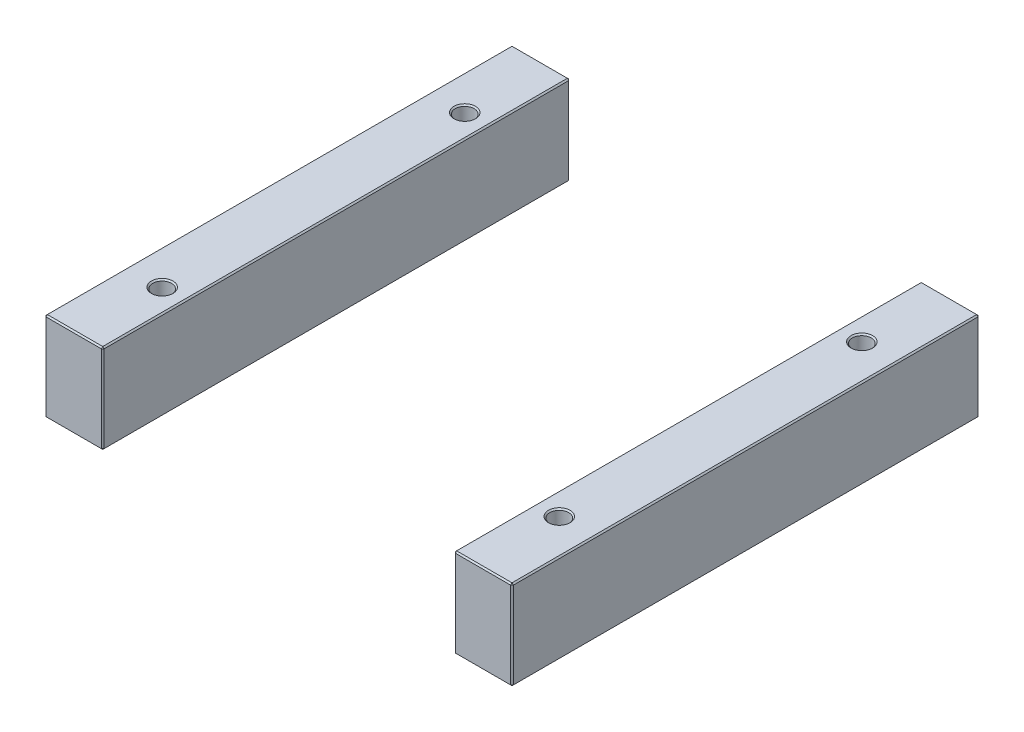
ISO-10303-21;
HEADER;
FILE_DESCRIPTION(('STEP AP214'),'2;1');
FILE_NAME('part.step','',(''),(''),'','','');
FILE_SCHEMA(('AUTOMOTIVE_DESIGN { 1 0 10303 214 1 1 1 1 }'));
ENDSEC;
DATA;
#1=APPLICATION_CONTEXT('core data for automotive mechanical design processes');
#2=APPLICATION_PROTOCOL_DEFINITION('international standard','automotive_design',2000,#1);
#3=PRODUCT_CONTEXT('',#1,'mechanical');
#4=PRODUCT('Part','Part','',(#3));
#5=PRODUCT_RELATED_PRODUCT_CATEGORY('part','',(#4));
#6=PRODUCT_DEFINITION_FORMATION('','',#4);
#7=PRODUCT_DEFINITION_CONTEXT('part definition',#1,'design');
#8=PRODUCT_DEFINITION('design','',#6,#7);
#9=PRODUCT_DEFINITION_SHAPE('','',#8);
#10=(LENGTH_UNIT() NAMED_UNIT(*) SI_UNIT(.MILLI.,.METRE.));
#11=(NAMED_UNIT(*) PLANE_ANGLE_UNIT() SI_UNIT($,.RADIAN.));
#12=(NAMED_UNIT(*) SI_UNIT($,.STERADIAN.) SOLID_ANGLE_UNIT());
#13=UNCERTAINTY_MEASURE_WITH_UNIT(LENGTH_MEASURE(1.E-05),#10,'distance_accuracy_value','');
#14=(GEOMETRIC_REPRESENTATION_CONTEXT(3) GLOBAL_UNCERTAINTY_ASSIGNED_CONTEXT((#13)) GLOBAL_UNIT_ASSIGNED_CONTEXT((#10,
#11,#12)) REPRESENTATION_CONTEXT('',''));
#15=CARTESIAN_POINT('',(0.,0.,0.));
#16=DIRECTION('',(0.,0.,1.));
#17=DIRECTION('',(1.,0.,0.));
#18=AXIS2_PLACEMENT_3D('',#15,#16,#17);
#19=CARTESIAN_POINT('',(-173.,66.,-173.));
#20=DIRECTION('',(0.,0.,1.));
#21=DIRECTION('',(1.,0.,0.));
#22=AXIS2_PLACEMENT_3D('',#19,#20,#21);
#23=PLANE('',#22);
#24=DIRECTION('',(-1.,0.,0.));
#25=VECTOR('',#24,1.);
#26=CARTESIAN_POINT('',(-173.,1.00000000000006,-173.));
#27=LINE('',#26,#25);
#28=CARTESIAN_POINT('',(-131.,1.00000000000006,-173.));
#29=VERTEX_POINT('',#28);
#30=CARTESIAN_POINT('',(-172.,1.00000000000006,-173.));
#31=VERTEX_POINT('',#30);
#32=EDGE_CURVE('P0_E137',#29,#31,#27,.T.);
#33=ORIENTED_EDGE('',*,*,#32,.T.);
#34=DIRECTION('',(0.,1.,0.));
#35=VECTOR('',#34,1.);
#36=CARTESIAN_POINT('',(-172.,66.,-173.));
#37=LINE('',#36,#35);
#38=CARTESIAN_POINT('',(-172.,65.,-173.));
#39=VERTEX_POINT('',#38);
#40=EDGE_CURVE('P0_E235',#31,#39,#37,.T.);
#41=ORIENTED_EDGE('',*,*,#40,.T.);
#42=DIRECTION('',(1.,0.,0.));
#43=VECTOR('',#42,1.);
#44=CARTESIAN_POINT('',(-173.,65.,-173.));
#45=LINE('',#44,#43);
#46=CARTESIAN_POINT('',(-131.,65.,-173.));
#47=VERTEX_POINT('',#46);
#48=EDGE_CURVE('P0_E233',#39,#47,#45,.T.);
#49=ORIENTED_EDGE('',*,*,#48,.T.);
#50=DIRECTION('',(0.,-1.,0.));
#51=VECTOR('',#50,1.);
#52=CARTESIAN_POINT('',(-131.,66.,-173.));
#53=LINE('',#52,#51);
#54=EDGE_CURVE('P0_E230',#47,#29,#53,.T.);
#55=ORIENTED_EDGE('',*,*,#54,.T.);
#56=EDGE_LOOP('',(#33,#41,#49,#55));
#57=FACE_BOUND('',#56,.T.);
#58=ADVANCED_FACE('P0_F16',(#57),#23,.F.);
#59=CARTESIAN_POINT('',(-173.,66.,173.));
#60=DIRECTION('',(1.,0.,0.));
#61=DIRECTION('',(0.,0.,-1.));
#62=AXIS2_PLACEMENT_3D('',#59,#60,#61);
#63=PLANE('',#62);
#64=DIRECTION('',(0.,1.,0.));
#65=VECTOR('',#64,1.);
#66=CARTESIAN_POINT('',(-173.,66.,172.));
#67=LINE('',#66,#65);
#68=CARTESIAN_POINT('',(-173.,1.00000000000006,172.));
#69=VERTEX_POINT('',#68);
#70=CARTESIAN_POINT('',(-173.,65.,172.));
#71=VERTEX_POINT('',#70);
#72=EDGE_CURVE('P0_E217',#69,#71,#67,.T.);
#73=ORIENTED_EDGE('',*,*,#72,.T.);
#74=DIRECTION('',(0.,0.,-1.));
#75=VECTOR('',#74,1.);
#76=CARTESIAN_POINT('',(-173.,65.,173.));
#77=LINE('',#76,#75);
#78=CARTESIAN_POINT('',(-173.,65.,-172.));
#79=VERTEX_POINT('',#78);
#80=EDGE_CURVE('P0_E228',#71,#79,#77,.T.);
#81=ORIENTED_EDGE('',*,*,#80,.T.);
#82=DIRECTION('',(0.,-1.,0.));
#83=VECTOR('',#82,1.);
#84=CARTESIAN_POINT('',(-173.,66.,-172.));
#85=LINE('',#84,#83);
#86=CARTESIAN_POINT('',(-173.,1.00000000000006,-172.));
#87=VERTEX_POINT('',#86);
#88=EDGE_CURVE('P0_E225',#79,#87,#85,.T.);
#89=ORIENTED_EDGE('',*,*,#88,.T.);
#90=DIRECTION('',(0.,0.,1.));
#91=VECTOR('',#90,1.);
#92=CARTESIAN_POINT('',(-173.,1.00000000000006,173.));
#93=LINE('',#92,#91);
#94=EDGE_CURVE('P0_E214',#87,#69,#93,.T.);
#95=ORIENTED_EDGE('',*,*,#94,.T.);
#96=EDGE_LOOP('',(#73,#81,#89,#95));
#97=FACE_BOUND('',#96,.T.);
#98=ADVANCED_FACE('P0_F302',(#97),#63,.F.);
#99=CARTESIAN_POINT('',(-173.,66.,173.));
#100=DIRECTION('',(0.,0.,-1.));
#101=DIRECTION('',(-1.,0.,0.));
#102=AXIS2_PLACEMENT_3D('',#99,#100,#101);
#103=PLANE('',#102);
#104=DIRECTION('',(-1.,0.,0.));
#105=VECTOR('',#104,1.);
#106=CARTESIAN_POINT('',(-173.,65.,173.));
#107=LINE('',#106,#105);
#108=CARTESIAN_POINT('',(-131.,65.,173.));
#109=VERTEX_POINT('',#108);
#110=CARTESIAN_POINT('',(-172.,65.,173.));
#111=VERTEX_POINT('',#110);
#112=EDGE_CURVE('P0_E242',#109,#111,#107,.T.);
#113=ORIENTED_EDGE('',*,*,#112,.T.);
#114=DIRECTION('',(0.,-1.,0.));
#115=VECTOR('',#114,1.);
#116=CARTESIAN_POINT('',(-172.,66.,173.));
#117=LINE('',#116,#115);
#118=CARTESIAN_POINT('',(-172.,1.00000000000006,173.));
#119=VERTEX_POINT('',#118);
#120=EDGE_CURVE('P0_E244',#111,#119,#117,.T.);
#121=ORIENTED_EDGE('',*,*,#120,.T.);
#122=DIRECTION('',(1.,0.,0.));
#123=VECTOR('',#122,1.);
#124=CARTESIAN_POINT('',(-130.,1.00000000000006,173.));
#125=LINE('',#124,#123);
#126=CARTESIAN_POINT('',(-131.,1.00000000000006,173.));
#127=VERTEX_POINT('',#126);
#128=EDGE_CURVE('P0_E240',#119,#127,#125,.T.);
#129=ORIENTED_EDGE('',*,*,#128,.T.);
#130=DIRECTION('',(0.,1.,0.));
#131=VECTOR('',#130,1.);
#132=CARTESIAN_POINT('',(-131.,66.,173.));
#133=LINE('',#132,#131);
#134=EDGE_CURVE('P0_E238',#127,#109,#133,.T.);
#135=ORIENTED_EDGE('',*,*,#134,.T.);
#136=EDGE_LOOP('',(#113,#121,#129,#135));
#137=FACE_BOUND('',#136,.T.);
#138=ADVANCED_FACE('P0_F341',(#137),#103,.F.);
#139=CARTESIAN_POINT('',(-130.,66.,-173.));
#140=DIRECTION('',(-1.,0.,0.));
#141=DIRECTION('',(0.,0.,1.));
#142=AXIS2_PLACEMENT_3D('',#139,#140,#141);
#143=PLANE('',#142);
#144=DIRECTION('',(0.,0.,1.));
#145=VECTOR('',#144,1.);
#146=CARTESIAN_POINT('',(-130.,65.,-173.));
#147=LINE('',#146,#145);
#148=CARTESIAN_POINT('',(-130.,65.,-172.));
#149=VERTEX_POINT('',#148);
#150=CARTESIAN_POINT('',(-130.,65.,172.));
#151=VERTEX_POINT('',#150);
#152=EDGE_CURVE('P0_E31',#149,#151,#147,.T.);
#153=ORIENTED_EDGE('',*,*,#152,.T.);
#154=DIRECTION('',(0.,-1.,0.));
#155=VECTOR('',#154,1.);
#156=CARTESIAN_POINT('',(-130.,66.,172.));
#157=LINE('',#156,#155);
#158=CARTESIAN_POINT('',(-130.,1.00000000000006,172.));
#159=VERTEX_POINT('',#158);
#160=EDGE_CURVE('P0_E190',#151,#159,#157,.T.);
#161=ORIENTED_EDGE('',*,*,#160,.T.);
#162=DIRECTION('',(0.,0.,-1.));
#163=VECTOR('',#162,1.);
#164=CARTESIAN_POINT('',(-130.,1.00000000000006,-173.));
#165=LINE('',#164,#163);
#166=CARTESIAN_POINT('',(-130.,1.00000000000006,-172.));
#167=VERTEX_POINT('',#166);
#168=EDGE_CURVE('P0_E256',#159,#167,#165,.T.);
#169=ORIENTED_EDGE('',*,*,#168,.T.);
#170=DIRECTION('',(0.,1.,0.));
#171=VECTOR('',#170,1.);
#172=CARTESIAN_POINT('',(-130.,66.,-172.));
#173=LINE('',#172,#171);
#174=EDGE_CURVE('P0_E36',#167,#149,#173,.T.);
#175=ORIENTED_EDGE('',*,*,#174,.T.);
#176=EDGE_LOOP('',(#153,#161,#169,#175));
#177=FACE_BOUND('',#176,.T.);
#178=ADVANCED_FACE('P0_F535',(#177),#143,.F.);
#179=CARTESIAN_POINT('',(0.,66.,0.));
#180=DIRECTION('',(0.,-1.,0.));
#181=DIRECTION('',(0.,0.,-1.));
#182=AXIS2_PLACEMENT_3D('',#179,#180,#181);
#183=PLANE('',#182);
#184=CARTESIAN_POINT('',(-147.,66.,112.));
#185=DIRECTION('',(0.,-1.,0.));
#186=DIRECTION('',(0.,0.,-1.));
#187=AXIS2_PLACEMENT_3D('',#184,#185,#186);
#188=CIRCLE('',#187,8.);
#189=CARTESIAN_POINT('',(-147.,66.,104.));
#190=VERTEX_POINT('',#189);
#191=EDGE_CURVE('P0_E24',#190,#190,#188,.T.);
#192=ORIENTED_EDGE('',*,*,#191,.T.);
#193=EDGE_LOOP('',(#192));
#194=FACE_BOUND('',#193,.T.);
#195=CARTESIAN_POINT('',(-147.,66.,-112.));
#196=DIRECTION('',(0.,-1.,0.));
#197=DIRECTION('',(0.,0.,-1.));
#198=AXIS2_PLACEMENT_3D('',#195,#196,#197);
#199=CIRCLE('',#198,8.);
#200=CARTESIAN_POINT('',(-147.,66.,-120.));
#201=VERTEX_POINT('',#200);
#202=EDGE_CURVE('P0_E189',#201,#201,#199,.T.);
#203=ORIENTED_EDGE('',*,*,#202,.T.);
#204=EDGE_LOOP('',(#203));
#205=FACE_BOUND('',#204,.T.);
#206=DIRECTION('',(0.,0.,1.));
#207=VECTOR('',#206,1.);
#208=CARTESIAN_POINT('',(-172.,66.,0.));
#209=LINE('',#208,#207);
#210=CARTESIAN_POINT('',(-172.,66.,-172.));
#211=VERTEX_POINT('',#210);
#212=CARTESIAN_POINT('',(-172.,66.,172.));
#213=VERTEX_POINT('',#212);
#214=EDGE_CURVE('P0_E251',#211,#213,#209,.T.);
#215=ORIENTED_EDGE('',*,*,#214,.T.);
#216=DIRECTION('',(1.,0.,0.));
#217=VECTOR('',#216,1.);
#218=CARTESIAN_POINT('',(1.11022302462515E-13,66.,172.));
#219=LINE('',#218,#217);
#220=CARTESIAN_POINT('',(-131.,66.,172.));
#221=VERTEX_POINT('',#220);
#222=EDGE_CURVE('P0_E253',#213,#221,#219,.T.);
#223=ORIENTED_EDGE('',*,*,#222,.T.);
#224=DIRECTION('',(0.,0.,-1.));
#225=VECTOR('',#224,1.);
#226=CARTESIAN_POINT('',(-131.,66.,0.));
#227=LINE('',#226,#225);
#228=CARTESIAN_POINT('',(-131.,66.,-172.));
#229=VERTEX_POINT('',#228);
#230=EDGE_CURVE('P0_E247',#221,#229,#227,.T.);
#231=ORIENTED_EDGE('',*,*,#230,.T.);
#232=DIRECTION('',(-1.,0.,0.));
#233=VECTOR('',#232,1.);
#234=CARTESIAN_POINT('',(-1.11022302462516E-13,66.,-172.));
#235=LINE('',#234,#233);
#236=EDGE_CURVE('P0_E249',#229,#211,#235,.T.);
#237=ORIENTED_EDGE('',*,*,#236,.T.);
#238=EDGE_LOOP('',(#215,#223,#231,#237));
#239=FACE_BOUND('',#238,.T.);
#240=ADVANCED_FACE('P0_F195',(#194,#205,#239),#183,.F.);
#241=CARTESIAN_POINT('',(0.,0.,0.));
#242=DIRECTION('',(0.,-1.,0.));
#243=DIRECTION('',(0.,0.,-1.));
#244=AXIS2_PLACEMENT_3D('',#241,#242,#243);
#245=PLANE('',#244);
#246=CARTESIAN_POINT('',(-147.,0.,-112.));
#247=DIRECTION('',(0.,-1.,0.));
#248=DIRECTION('',(0.,0.,-1.));
#249=AXIS2_PLACEMENT_3D('',#246,#247,#248);
#250=CIRCLE('',#249,8.);
#251=CARTESIAN_POINT('',(-147.,0.,-120.));
#252=VERTEX_POINT('',#251);
#253=EDGE_CURVE('P0_E220',#252,#252,#250,.F.);
#254=ORIENTED_EDGE('',*,*,#253,.T.);
#255=EDGE_LOOP('',(#254));
#256=FACE_BOUND('',#255,.T.);
#257=CARTESIAN_POINT('',(-147.,0.,112.));
#258=DIRECTION('',(0.,-1.,0.));
#259=DIRECTION('',(0.,0.,-1.));
#260=AXIS2_PLACEMENT_3D('',#257,#258,#259);
#261=CIRCLE('',#260,8.);
#262=CARTESIAN_POINT('',(-147.,0.,104.));
#263=VERTEX_POINT('',#262);
#264=EDGE_CURVE('P0_E608',#263,#263,#261,.F.);
#265=ORIENTED_EDGE('',*,*,#264,.T.);
#266=EDGE_LOOP('',(#265));
#267=FACE_BOUND('',#266,.T.);
#268=DIRECTION('',(-1.,0.,0.));
#269=VECTOR('',#268,1.);
#270=CARTESIAN_POINT('',(-173.,0.,172.));
#271=LINE('',#270,#269);
#272=CARTESIAN_POINT('',(-131.,0.,172.));
#273=VERTEX_POINT('',#272);
#274=CARTESIAN_POINT('',(-172.,0.,172.));
#275=VERTEX_POINT('',#274);
#276=EDGE_CURVE('P0_E114',#273,#275,#271,.T.);
#277=ORIENTED_EDGE('',*,*,#276,.T.);
#278=DIRECTION('',(0.,0.,-1.));
#279=VECTOR('',#278,1.);
#280=CARTESIAN_POINT('',(-172.,0.,-173.));
#281=LINE('',#280,#279);
#282=CARTESIAN_POINT('',(-172.,0.,-172.));
#283=VERTEX_POINT('',#282);
#284=EDGE_CURVE('P0_E110',#275,#283,#281,.T.);
#285=ORIENTED_EDGE('',*,*,#284,.T.);
#286=DIRECTION('',(1.,0.,0.));
#287=VECTOR('',#286,1.);
#288=CARTESIAN_POINT('',(-130.,0.,-172.));
#289=LINE('',#288,#287);
#290=CARTESIAN_POINT('',(-131.,0.,-172.));
#291=VERTEX_POINT('',#290);
#292=EDGE_CURVE('P0_E104',#283,#291,#289,.T.);
#293=ORIENTED_EDGE('',*,*,#292,.T.);
#294=DIRECTION('',(0.,0.,1.));
#295=VECTOR('',#294,1.);
#296=CARTESIAN_POINT('',(-131.,0.,173.));
#297=LINE('',#296,#295);
#298=EDGE_CURVE('P0_E107',#291,#273,#297,.T.);
#299=ORIENTED_EDGE('',*,*,#298,.T.);
#300=EDGE_LOOP('',(#277,#285,#293,#299));
#301=FACE_BOUND('',#300,.T.);
#302=ADVANCED_FACE('P0_F106',(#256,#267,#301),#245,.T.);
#303=CARTESIAN_POINT('',(-147.,0.,-112.));
#304=DIRECTION('',(0.,1.,0.));
#305=DIRECTION('',(0.,0.,1.));
#306=AXIS2_PLACEMENT_3D('',#303,#304,#305);
#307=CYLINDRICAL_SURFACE('',#306,7.);
#308=CARTESIAN_POINT('',(-147.,65.,-112.));
#309=DIRECTION('',(0.,-1.,0.));
#310=DIRECTION('',(0.,0.,-1.));
#311=AXIS2_PLACEMENT_3D('',#308,#309,#310);
#312=CIRCLE('',#311,7.);
#313=CARTESIAN_POINT('',(-147.,65.,-119.));
#314=VERTEX_POINT('',#313);
#315=EDGE_CURVE('P0_E10',#314,#314,#312,.F.);
#316=ORIENTED_EDGE('',*,*,#315,.T.);
#317=EDGE_LOOP('',(#316));
#318=FACE_BOUND('',#317,.T.);
#319=CARTESIAN_POINT('',(-147.,0.999999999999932,-112.));
#320=DIRECTION('',(0.,-1.,0.));
#321=DIRECTION('',(0.,0.,-1.));
#322=AXIS2_PLACEMENT_3D('',#319,#320,#321);
#323=CIRCLE('',#322,7.);
#324=CARTESIAN_POINT('',(-147.,0.999999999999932,-119.));
#325=VERTEX_POINT('',#324);
#326=EDGE_CURVE('P0_E215',#325,#325,#323,.T.);
#327=ORIENTED_EDGE('',*,*,#326,.T.);
#328=EDGE_LOOP('',(#327));
#329=FACE_BOUND('',#328,.T.);
#330=ADVANCED_FACE('P0_F208',(#318,#329),#307,.F.);
#331=CARTESIAN_POINT('',(-147.,0.,112.));
#332=DIRECTION('',(0.,1.,0.));
#333=DIRECTION('',(0.,0.,1.));
#334=AXIS2_PLACEMENT_3D('',#331,#332,#333);
#335=CYLINDRICAL_SURFACE('',#334,7.);
#336=CARTESIAN_POINT('',(-147.,65.,112.));
#337=DIRECTION('',(0.,-1.,0.));
#338=DIRECTION('',(0.,0.,-1.));
#339=AXIS2_PLACEMENT_3D('',#336,#337,#338);
#340=CIRCLE('',#339,7.);
#341=CARTESIAN_POINT('',(-147.,65.,105.));
#342=VERTEX_POINT('',#341);
#343=EDGE_CURVE('P0_E186',#342,#342,#340,.F.);
#344=ORIENTED_EDGE('',*,*,#343,.T.);
#345=EDGE_LOOP('',(#344));
#346=FACE_BOUND('',#345,.T.);
#347=CARTESIAN_POINT('',(-147.,0.999999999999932,112.));
#348=DIRECTION('',(0.,-1.,0.));
#349=DIRECTION('',(0.,0.,-1.));
#350=AXIS2_PLACEMENT_3D('',#347,#348,#349);
#351=CIRCLE('',#350,7.);
#352=CARTESIAN_POINT('',(-147.,0.999999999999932,105.));
#353=VERTEX_POINT('',#352);
#354=EDGE_CURVE('P0_E212',#353,#353,#351,.T.);
#355=ORIENTED_EDGE('',*,*,#354,.T.);
#356=EDGE_LOOP('',(#355));
#357=FACE_BOUND('',#356,.T.);
#358=ADVANCED_FACE('P0_F204',(#346,#357),#335,.F.);
#359=CARTESIAN_POINT('',(-147.,0.,-112.));
#360=DIRECTION('',(0.,-1.,0.));
#361=DIRECTION('',(0.,0.,-1.));
#362=AXIS2_PLACEMENT_3D('',#359,#360,#361);
#363=CONICAL_SURFACE('',#362,8.,0.785398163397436);
#364=ORIENTED_EDGE('',*,*,#326,.F.);
#365=EDGE_LOOP('',(#364));
#366=FACE_BOUND('',#365,.T.);
#367=ORIENTED_EDGE('',*,*,#253,.F.);
#368=EDGE_LOOP('',(#367));
#369=FACE_BOUND('',#368,.T.);
#370=ADVANCED_FACE('P0_F207',(#366,#369),#363,.F.);
#371=CARTESIAN_POINT('',(-147.,0.,112.));
#372=DIRECTION('',(0.,-1.,0.));
#373=DIRECTION('',(0.,0.,-1.));
#374=AXIS2_PLACEMENT_3D('',#371,#372,#373);
#375=CONICAL_SURFACE('',#374,8.,0.785398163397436);
#376=ORIENTED_EDGE('',*,*,#354,.F.);
#377=EDGE_LOOP('',(#376));
#378=FACE_BOUND('',#377,.T.);
#379=ORIENTED_EDGE('',*,*,#264,.F.);
#380=EDGE_LOOP('',(#379));
#381=FACE_BOUND('',#380,.T.);
#382=ADVANCED_FACE('P0_F347',(#378,#381),#375,.F.);
#383=CARTESIAN_POINT('',(-130.,66.,172.));
#384=DIRECTION('',(-0.707106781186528,0.,-0.707106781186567));
#385=DIRECTION('',(0.,-1.,0.));
#386=AXIS2_PLACEMENT_3D('',#383,#384,#385);
#387=PLANE('',#386);
#388=DIRECTION('',(-0.707106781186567,0.,0.707106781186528));
#389=VECTOR('',#388,1.);
#390=CARTESIAN_POINT('',(-130.5,65.,172.5));
#391=LINE('',#390,#389);
#392=EDGE_CURVE('P0_E125',#109,#151,#391,.F.);
#393=ORIENTED_EDGE('',*,*,#392,.F.);
#394=ORIENTED_EDGE('',*,*,#134,.F.);
#395=DIRECTION('',(0.707106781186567,0.,-0.707106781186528));
#396=VECTOR('',#395,1.);
#397=CARTESIAN_POINT('',(-131.,1.00000000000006,173.));
#398=LINE('',#397,#396);
#399=EDGE_CURVE('P0_E181',#159,#127,#398,.F.);
#400=ORIENTED_EDGE('',*,*,#399,.F.);
#401=ORIENTED_EDGE('',*,*,#160,.F.);
#402=EDGE_LOOP('',(#393,#394,#400,#401));
#403=FACE_BOUND('',#402,.T.);
#404=ADVANCED_FACE('P0_F351',(#403),#387,.F.);
#405=CARTESIAN_POINT('',(-131.,66.,172.));
#406=DIRECTION('',(0.577350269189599,0.577350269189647,0.577350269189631));
#407=DIRECTION('',(0.,-0.707106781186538,0.707106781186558));
#408=AXIS2_PLACEMENT_3D('',#405,#406,#407);
#409=PLANE('',#408);
#410=DIRECTION('',(0.,0.707106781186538,-0.707106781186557));
#411=VECTOR('',#410,1.);
#412=CARTESIAN_POINT('',(-131.,66.,172.));
#413=LINE('',#412,#411);
#414=EDGE_CURVE('P0_E175',#109,#221,#413,.T.);
#415=ORIENTED_EDGE('',*,*,#414,.F.);
#416=ORIENTED_EDGE('',*,*,#392,.T.);
#417=DIRECTION('',(0.707106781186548,-0.707106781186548,0.));
#418=VECTOR('',#417,1.);
#419=CARTESIAN_POINT('',(-131.,66.,172.));
#420=LINE('',#419,#418);
#421=EDGE_CURVE('P0_E178',#221,#151,#420,.T.);
#422=ORIENTED_EDGE('',*,*,#421,.F.);
#423=EDGE_LOOP('',(#415,#416,#422));
#424=FACE_BOUND('',#423,.T.);
#425=ADVANCED_FACE('P0_F487',(#424),#409,.T.);
#426=CARTESIAN_POINT('',(-131.,1.00000000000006,173.));
#427=DIRECTION('',(0.577350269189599,-0.577350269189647,0.577350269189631));
#428=DIRECTION('',(0.,-0.707106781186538,-0.707106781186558));
#429=AXIS2_PLACEMENT_3D('',#426,#427,#428);
#430=PLANE('',#429);
#431=DIRECTION('',(0.707106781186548,0.707106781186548,0.));
#432=VECTOR('',#431,1.);
#433=CARTESIAN_POINT('',(-130.5,0.50000000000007,172.));
#434=LINE('',#433,#432);
#435=EDGE_CURVE('P0_E123',#159,#273,#434,.F.);
#436=ORIENTED_EDGE('',*,*,#435,.F.);
#437=ORIENTED_EDGE('',*,*,#399,.T.);
#438=DIRECTION('',(0.,-0.707106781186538,-0.707106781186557));
#439=VECTOR('',#438,1.);
#440=CARTESIAN_POINT('',(-131.,1.00000000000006,173.));
#441=LINE('',#440,#439);
#442=EDGE_CURVE('P0_E172',#273,#127,#441,.F.);
#443=ORIENTED_EDGE('',*,*,#442,.F.);
#444=EDGE_LOOP('',(#436,#437,#443));
#445=FACE_BOUND('',#444,.T.);
#446=ADVANCED_FACE('P0_F478',(#445),#430,.T.);
#447=CARTESIAN_POINT('',(-131.,66.,0.));
#448=DIRECTION('',(-0.707106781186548,-0.707106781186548,0.));
#449=DIRECTION('',(0.,0.,-1.));
#450=AXIS2_PLACEMENT_3D('',#447,#448,#449);
#451=PLANE('',#450);
#452=ORIENTED_EDGE('',*,*,#421,.T.);
#453=ORIENTED_EDGE('',*,*,#152,.F.);
#454=DIRECTION('',(-0.707106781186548,0.707106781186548,0.));
#455=VECTOR('',#454,1.);
#456=CARTESIAN_POINT('',(-130.5,65.5,-172.));
#457=LINE('',#456,#455);
#458=EDGE_CURVE('P0_E165',#229,#149,#457,.F.);
#459=ORIENTED_EDGE('',*,*,#458,.F.);
#460=ORIENTED_EDGE('',*,*,#230,.F.);
#461=EDGE_LOOP('',(#452,#453,#459,#460));
#462=FACE_BOUND('',#461,.T.);
#463=ADVANCED_FACE('P0_F318',(#462),#451,.F.);
#464=CARTESIAN_POINT('',(1.11022302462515E-13,66.,172.));
#465=DIRECTION('',(0.,-0.707106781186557,-0.707106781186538));
#466=DIRECTION('',(1.,0.,0.));
#467=AXIS2_PLACEMENT_3D('',#464,#465,#466);
#468=PLANE('',#467);
#469=ORIENTED_EDGE('',*,*,#414,.T.);
#470=ORIENTED_EDGE('',*,*,#222,.F.);
#471=DIRECTION('',(0.,-0.707106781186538,0.707106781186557));
#472=VECTOR('',#471,1.);
#473=CARTESIAN_POINT('',(-172.,65.5,172.5));
#474=LINE('',#473,#472);
#475=EDGE_CURVE('P0_E162',#111,#213,#474,.F.);
#476=ORIENTED_EDGE('',*,*,#475,.F.);
#477=ORIENTED_EDGE('',*,*,#112,.F.);
#478=EDGE_LOOP('',(#469,#470,#476,#477));
#479=FACE_BOUND('',#478,.T.);
#480=ADVANCED_FACE('P0_F313',(#479),#468,.F.);
#481=CARTESIAN_POINT('',(-172.,66.,173.));
#482=DIRECTION('',(0.707106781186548,0.,-0.707106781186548));
#483=DIRECTION('',(0.,-1.,0.));
#484=AXIS2_PLACEMENT_3D('',#481,#482,#483);
#485=PLANE('',#484);
#486=DIRECTION('',(0.707106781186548,0.,0.707106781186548));
#487=VECTOR('',#486,1.);
#488=CARTESIAN_POINT('',(-172.,1.00000000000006,173.));
#489=LINE('',#488,#487);
#490=EDGE_CURVE('P0_E156',#119,#69,#489,.F.);
#491=ORIENTED_EDGE('',*,*,#490,.F.);
#492=ORIENTED_EDGE('',*,*,#120,.F.);
#493=DIRECTION('',(-0.707106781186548,0.,-0.707106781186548));
#494=VECTOR('',#493,1.);
#495=CARTESIAN_POINT('',(-173.,65.,172.));
#496=LINE('',#495,#494);
#497=EDGE_CURVE('P0_E159',#71,#111,#496,.F.);
#498=ORIENTED_EDGE('',*,*,#497,.F.);
#499=ORIENTED_EDGE('',*,*,#72,.F.);
#500=EDGE_LOOP('',(#491,#492,#498,#499));
#501=FACE_BOUND('',#500,.T.);
#502=ADVANCED_FACE('P0_F307',(#501),#485,.F.);
#503=CARTESIAN_POINT('',(-173.,1.00000000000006,173.));
#504=DIRECTION('',(0.,-0.707106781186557,0.707106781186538));
#505=DIRECTION('',(-1.,0.,0.));
#506=AXIS2_PLACEMENT_3D('',#503,#504,#505);
#507=PLANE('',#506);
#508=ORIENTED_EDGE('',*,*,#442,.T.);
#509=ORIENTED_EDGE('',*,*,#128,.F.);
#510=DIRECTION('',(0.,0.707106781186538,0.707106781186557));
#511=VECTOR('',#510,1.);
#512=CARTESIAN_POINT('',(-172.,1.00000000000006,173.));
#513=LINE('',#512,#511);
#514=EDGE_CURVE('P0_E134',#275,#119,#513,.T.);
#515=ORIENTED_EDGE('',*,*,#514,.F.);
#516=ORIENTED_EDGE('',*,*,#276,.F.);
#517=EDGE_LOOP('',(#508,#509,#515,#516));
#518=FACE_BOUND('',#517,.T.);
#519=ADVANCED_FACE('P0_F333',(#518),#507,.T.);
#520=CARTESIAN_POINT('',(-130.,1.00000000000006,-173.));
#521=DIRECTION('',(0.707106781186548,-0.707106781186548,0.));
#522=DIRECTION('',(0.,0.,1.));
#523=AXIS2_PLACEMENT_3D('',#520,#521,#522);
#524=PLANE('',#523);
#525=ORIENTED_EDGE('',*,*,#435,.T.);
#526=ORIENTED_EDGE('',*,*,#298,.F.);
#527=DIRECTION('',(-0.707106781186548,-0.707106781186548,0.));
#528=VECTOR('',#527,1.);
#529=CARTESIAN_POINT('',(-131.,0.,-172.));
#530=LINE('',#529,#528);
#531=EDGE_CURVE('P0_E120',#167,#291,#530,.T.);
#532=ORIENTED_EDGE('',*,*,#531,.F.);
#533=ORIENTED_EDGE('',*,*,#168,.F.);
#534=EDGE_LOOP('',(#525,#526,#532,#533));
#535=FACE_BOUND('',#534,.T.);
#536=ADVANCED_FACE('P0_F119',(#535),#524,.T.);
#537=CARTESIAN_POINT('',(-131.,66.,-173.));
#538=DIRECTION('',(-0.707106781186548,0.,0.707106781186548));
#539=DIRECTION('',(0.,-1.,0.));
#540=AXIS2_PLACEMENT_3D('',#537,#538,#539);
#541=PLANE('',#540);
#542=DIRECTION('',(0.707106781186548,0.,0.707106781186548));
#543=VECTOR('',#542,1.);
#544=CARTESIAN_POINT('',(-131.,65.,-173.));
#545=LINE('',#544,#543);
#546=EDGE_CURVE('P0_E168',#149,#47,#545,.F.);
#547=ORIENTED_EDGE('',*,*,#546,.F.);
#548=ORIENTED_EDGE('',*,*,#174,.F.);
#549=DIRECTION('',(-0.707106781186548,0.,-0.707106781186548));
#550=VECTOR('',#549,1.);
#551=CARTESIAN_POINT('',(-130.5,1.00000000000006,-172.5));
#552=LINE('',#551,#550);
#553=EDGE_CURVE('P0_E133',#29,#167,#552,.F.);
#554=ORIENTED_EDGE('',*,*,#553,.F.);
#555=ORIENTED_EDGE('',*,*,#54,.F.);
#556=EDGE_LOOP('',(#547,#548,#554,#555));
#557=FACE_BOUND('',#556,.T.);
#558=ADVANCED_FACE('P0_F323',(#557),#541,.F.);
#559=CARTESIAN_POINT('',(-131.,65.,-173.));
#560=DIRECTION('',(0.57735026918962,0.577350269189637,-0.57735026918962));
#561=DIRECTION('',(0.,0.707106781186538,0.707106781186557));
#562=AXIS2_PLACEMENT_3D('',#559,#560,#561);
#563=PLANE('',#562);
#564=ORIENTED_EDGE('',*,*,#458,.T.);
#565=ORIENTED_EDGE('',*,*,#546,.T.);
#566=DIRECTION('',(0.,-0.707106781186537,-0.707106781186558));
#567=VECTOR('',#566,1.);
#568=CARTESIAN_POINT('',(-131.,65.,-173.));
#569=LINE('',#568,#567);
#570=EDGE_CURVE('P0_E151',#229,#47,#569,.T.);
#571=ORIENTED_EDGE('',*,*,#570,.F.);
#572=EDGE_LOOP('',(#564,#565,#571));
#573=FACE_BOUND('',#572,.T.);
#574=ADVANCED_FACE('P0_F321',(#573),#563,.T.);
#575=CARTESIAN_POINT('',(-173.,65.,172.));
#576=DIRECTION('',(-0.57735026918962,0.577350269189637,0.57735026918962));
#577=DIRECTION('',(0.,-0.707106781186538,0.707106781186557));
#578=AXIS2_PLACEMENT_3D('',#575,#576,#577);
#579=PLANE('',#578);
#580=ORIENTED_EDGE('',*,*,#497,.T.);
#581=ORIENTED_EDGE('',*,*,#475,.T.);
#582=DIRECTION('',(0.707106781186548,0.707106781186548,0.));
#583=VECTOR('',#582,1.);
#584=CARTESIAN_POINT('',(-173.,65.,172.));
#585=LINE('',#584,#583);
#586=EDGE_CURVE('P0_E142',#71,#213,#585,.T.);
#587=ORIENTED_EDGE('',*,*,#586,.F.);
#588=EDGE_LOOP('',(#580,#581,#587));
#589=FACE_BOUND('',#588,.T.);
#590=ADVANCED_FACE('P0_F310',(#589),#579,.T.);
#591=CARTESIAN_POINT('',(-172.,1.00000000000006,173.));
#592=DIRECTION('',(-0.57735026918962,-0.577350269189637,0.57735026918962));
#593=DIRECTION('',(0.,-0.707106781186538,-0.707106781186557));
#594=AXIS2_PLACEMENT_3D('',#591,#592,#593);
#595=PLANE('',#594);
#596=ORIENTED_EDGE('',*,*,#514,.T.);
#597=ORIENTED_EDGE('',*,*,#490,.T.);
#598=DIRECTION('',(0.707106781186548,-0.707106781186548,0.));
#599=VECTOR('',#598,1.);
#600=CARTESIAN_POINT('',(-172.5,0.500000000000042,172.));
#601=LINE('',#600,#599);
#602=EDGE_CURVE('P0_E138',#275,#69,#601,.F.);
#603=ORIENTED_EDGE('',*,*,#602,.F.);
#604=EDGE_LOOP('',(#596,#597,#603));
#605=FACE_BOUND('',#604,.T.);
#606=ADVANCED_FACE('P0_F368',(#605),#595,.T.);
#607=CARTESIAN_POINT('',(-131.,0.,-172.));
#608=DIRECTION('',(0.57735026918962,-0.577350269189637,-0.57735026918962));
#609=DIRECTION('',(0.,0.707106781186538,-0.707106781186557));
#610=AXIS2_PLACEMENT_3D('',#607,#608,#609);
#611=PLANE('',#610);
#612=ORIENTED_EDGE('',*,*,#553,.T.);
#613=ORIENTED_EDGE('',*,*,#531,.T.);
#614=DIRECTION('',(0.,0.707106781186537,-0.707106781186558));
#615=VECTOR('',#614,1.);
#616=CARTESIAN_POINT('',(-131.,0.,-172.));
#617=LINE('',#616,#615);
#618=EDGE_CURVE('P0_E130',#29,#291,#617,.F.);
#619=ORIENTED_EDGE('',*,*,#618,.F.);
#620=EDGE_LOOP('',(#612,#613,#619));
#621=FACE_BOUND('',#620,.T.);
#622=ADVANCED_FACE('P0_F129',(#621),#611,.T.);
#623=CARTESIAN_POINT('',(-1.11022302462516E-13,66.,-172.));
#624=DIRECTION('',(0.,-0.707106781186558,0.707106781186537));
#625=DIRECTION('',(-1.,0.,0.));
#626=AXIS2_PLACEMENT_3D('',#623,#624,#625);
#627=PLANE('',#626);
#628=ORIENTED_EDGE('',*,*,#570,.T.);
#629=ORIENTED_EDGE('',*,*,#48,.F.);
#630=DIRECTION('',(0.,0.707106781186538,0.707106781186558));
#631=VECTOR('',#630,1.);
#632=CARTESIAN_POINT('',(-172.,65.,-173.));
#633=LINE('',#632,#631);
#634=EDGE_CURVE('P0_E139',#211,#39,#633,.F.);
#635=ORIENTED_EDGE('',*,*,#634,.F.);
#636=ORIENTED_EDGE('',*,*,#236,.F.);
#637=EDGE_LOOP('',(#628,#629,#635,#636));
#638=FACE_BOUND('',#637,.T.);
#639=ADVANCED_FACE('P0_F286',(#638),#627,.F.);
#640=CARTESIAN_POINT('',(-172.,66.,0.));
#641=DIRECTION('',(0.707106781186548,-0.707106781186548,0.));
#642=DIRECTION('',(0.,0.,1.));
#643=AXIS2_PLACEMENT_3D('',#640,#641,#642);
#644=PLANE('',#643);
#645=ORIENTED_EDGE('',*,*,#586,.T.);
#646=ORIENTED_EDGE('',*,*,#214,.F.);
#647=DIRECTION('',(-0.707106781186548,-0.707106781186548,0.));
#648=VECTOR('',#647,1.);
#649=CARTESIAN_POINT('',(-172.5,65.5,-172.));
#650=LINE('',#649,#648);
#651=EDGE_CURVE('P0_E145',#79,#211,#650,.F.);
#652=ORIENTED_EDGE('',*,*,#651,.F.);
#653=ORIENTED_EDGE('',*,*,#80,.F.);
#654=EDGE_LOOP('',(#645,#646,#652,#653));
#655=FACE_BOUND('',#654,.T.);
#656=ADVANCED_FACE('P0_F280',(#655),#644,.F.);
#657=CARTESIAN_POINT('',(-173.,1.00000000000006,173.));
#658=DIRECTION('',(-0.707106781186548,-0.707106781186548,0.));
#659=DIRECTION('',(0.,0.,-1.));
#660=AXIS2_PLACEMENT_3D('',#657,#658,#659);
#661=PLANE('',#660);
#662=ORIENTED_EDGE('',*,*,#602,.T.);
#663=ORIENTED_EDGE('',*,*,#94,.F.);
#664=DIRECTION('',(-0.707106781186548,0.707106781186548,0.));
#665=VECTOR('',#664,1.);
#666=CARTESIAN_POINT('',(-173.,1.00000000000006,-172.));
#667=LINE('',#666,#665);
#668=EDGE_CURVE('P0_E267',#283,#87,#667,.T.);
#669=ORIENTED_EDGE('',*,*,#668,.F.);
#670=ORIENTED_EDGE('',*,*,#284,.F.);
#671=EDGE_LOOP('',(#662,#663,#669,#670));
#672=FACE_BOUND('',#671,.T.);
#673=ADVANCED_FACE('P0_F298',(#672),#661,.T.);
#674=CARTESIAN_POINT('',(-173.,1.00000000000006,-173.));
#675=DIRECTION('',(0.,-0.707106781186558,-0.707106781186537));
#676=DIRECTION('',(1.,0.,0.));
#677=AXIS2_PLACEMENT_3D('',#674,#675,#676);
#678=PLANE('',#677);
#679=ORIENTED_EDGE('',*,*,#618,.T.);
#680=ORIENTED_EDGE('',*,*,#292,.F.);
#681=DIRECTION('',(0.,-0.707106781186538,0.707106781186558));
#682=VECTOR('',#681,1.);
#683=CARTESIAN_POINT('',(-172.,0.500000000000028,-172.5));
#684=LINE('',#683,#682);
#685=EDGE_CURVE('P0_E265',#31,#283,#684,.T.);
#686=ORIENTED_EDGE('',*,*,#685,.F.);
#687=ORIENTED_EDGE('',*,*,#32,.F.);
#688=EDGE_LOOP('',(#679,#680,#686,#687));
#689=FACE_BOUND('',#688,.T.);
#690=ADVANCED_FACE('P0_F136',(#689),#678,.T.);
#691=CARTESIAN_POINT('',(-172.,65.,-173.));
#692=DIRECTION('',(-0.57735026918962,0.577350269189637,-0.57735026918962));
#693=DIRECTION('',(0.,0.707106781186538,0.707106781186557));
#694=AXIS2_PLACEMENT_3D('',#691,#692,#693);
#695=PLANE('',#694);
#696=ORIENTED_EDGE('',*,*,#651,.T.);
#697=ORIENTED_EDGE('',*,*,#634,.T.);
#698=DIRECTION('',(0.707106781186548,0.,-0.707106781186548));
#699=VECTOR('',#698,1.);
#700=CARTESIAN_POINT('',(-172.,65.,-173.));
#701=LINE('',#700,#699);
#702=EDGE_CURVE('P0_E263',#79,#39,#701,.T.);
#703=ORIENTED_EDGE('',*,*,#702,.F.);
#704=EDGE_LOOP('',(#696,#697,#703));
#705=FACE_BOUND('',#704,.T.);
#706=ADVANCED_FACE('P0_F273',(#705),#695,.T.);
#707=CARTESIAN_POINT('',(-173.,1.00000000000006,-172.));
#708=DIRECTION('',(-0.57735026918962,-0.577350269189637,-0.57735026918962));
#709=DIRECTION('',(0.,0.707106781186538,-0.707106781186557));
#710=AXIS2_PLACEMENT_3D('',#707,#708,#709);
#711=PLANE('',#710);
#712=ORIENTED_EDGE('',*,*,#685,.T.);
#713=ORIENTED_EDGE('',*,*,#668,.T.);
#714=DIRECTION('',(-0.707106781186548,0.,0.707106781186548));
#715=VECTOR('',#714,1.);
#716=CARTESIAN_POINT('',(-173.,1.00000000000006,-172.));
#717=LINE('',#716,#715);
#718=EDGE_CURVE('P0_E261',#31,#87,#717,.T.);
#719=ORIENTED_EDGE('',*,*,#718,.F.);
#720=EDGE_LOOP('',(#712,#713,#719));
#721=FACE_BOUND('',#720,.T.);
#722=ADVANCED_FACE('P0_F294',(#721),#711,.T.);
#723=CARTESIAN_POINT('',(-173.,66.,-172.));
#724=DIRECTION('',(0.707106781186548,0.,0.707106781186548));
#725=DIRECTION('',(0.,-1.,0.));
#726=AXIS2_PLACEMENT_3D('',#723,#724,#725);
#727=PLANE('',#726);
#728=ORIENTED_EDGE('',*,*,#702,.T.);
#729=ORIENTED_EDGE('',*,*,#40,.F.);
#730=ORIENTED_EDGE('',*,*,#718,.T.);
#731=ORIENTED_EDGE('',*,*,#88,.F.);
#732=EDGE_LOOP('',(#728,#729,#730,#731));
#733=FACE_BOUND('',#732,.T.);
#734=ADVANCED_FACE('P0_F201',(#733),#727,.F.);
#735=CARTESIAN_POINT('',(-147.,65.,112.));
#736=DIRECTION('',(0.,1.,0.));
#737=DIRECTION('',(0.,0.,1.));
#738=AXIS2_PLACEMENT_3D('',#735,#736,#737);
#739=CONICAL_SURFACE('',#738,7.,0.785398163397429);
#740=ORIENTED_EDGE('',*,*,#191,.F.);
#741=EDGE_LOOP('',(#740));
#742=FACE_BOUND('',#741,.T.);
#743=ORIENTED_EDGE('',*,*,#343,.F.);
#744=EDGE_LOOP('',(#743));
#745=FACE_BOUND('',#744,.T.);
#746=ADVANCED_FACE('P0_F198',(#742,#745),#739,.F.);
#747=CARTESIAN_POINT('',(-147.,65.,-112.));
#748=DIRECTION('',(0.,1.,0.));
#749=DIRECTION('',(0.,0.,1.));
#750=AXIS2_PLACEMENT_3D('',#747,#748,#749);
#751=CONICAL_SURFACE('',#750,7.,0.785398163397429);
#752=ORIENTED_EDGE('',*,*,#202,.F.);
#753=EDGE_LOOP('',(#752));
#754=FACE_BOUND('',#753,.T.);
#755=ORIENTED_EDGE('',*,*,#315,.F.);
#756=EDGE_LOOP('',(#755));
#757=FACE_BOUND('',#756,.T.);
#758=ADVANCED_FACE('P0_F18',(#754,#757),#751,.F.);
#759=CLOSED_SHELL('',(#58,#98,#138,#178,#240,#302,#330,#358,#370,#382,#404,#425,#446,#463,#480,
#502,#519,#536,#558,#574,#590,#606,#622,#639,#656,#673,#690,#706,#722,#734,#746,#758));
#760=MANIFOLD_SOLID_BREP('P0_B1',#759);
#761=CARTESIAN_POINT('',(173.,66.,173.));
#762=DIRECTION('',(0.,0.,-1.));
#763=DIRECTION('',(-1.,0.,0.));
#764=AXIS2_PLACEMENT_3D('',#761,#762,#763);
#765=PLANE('',#764);
#766=DIRECTION('',(0.,-1.,0.));
#767=VECTOR('',#766,1.);
#768=CARTESIAN_POINT('',(131.,66.,173.));
#769=LINE('',#768,#767);
#770=CARTESIAN_POINT('',(131.,65.,173.));
#771=VERTEX_POINT('',#770);
#772=CARTESIAN_POINT('',(131.,0.999999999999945,173.));
#773=VERTEX_POINT('',#772);
#774=EDGE_CURVE('P1_E173',#771,#773,#769,.T.);
#775=ORIENTED_EDGE('',*,*,#774,.T.);
#776=DIRECTION('',(1.,0.,0.));
#777=VECTOR('',#776,1.);
#778=CARTESIAN_POINT('',(173.,0.999999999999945,173.));
#779=LINE('',#778,#777);
#780=CARTESIAN_POINT('',(172.,0.999999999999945,173.));
#781=VERTEX_POINT('',#780);
#782=EDGE_CURVE('P1_E175',#773,#781,#779,.T.);
#783=ORIENTED_EDGE('',*,*,#782,.T.);
#784=DIRECTION('',(0.,1.,0.));
#785=VECTOR('',#784,1.);
#786=CARTESIAN_POINT('',(172.,66.,173.));
#787=LINE('',#786,#785);
#788=CARTESIAN_POINT('',(172.,65.,173.));
#789=VERTEX_POINT('',#788);
#790=EDGE_CURVE('P1_E171',#781,#789,#787,.T.);
#791=ORIENTED_EDGE('',*,*,#790,.T.);
#792=DIRECTION('',(-1.,0.,0.));
#793=VECTOR('',#792,1.);
#794=CARTESIAN_POINT('',(130.,65.,173.));
#795=LINE('',#794,#793);
#796=EDGE_CURVE('P1_E169',#789,#771,#795,.T.);
#797=ORIENTED_EDGE('',*,*,#796,.T.);
#798=EDGE_LOOP('',(#775,#783,#791,#797));
#799=FACE_BOUND('',#798,.T.);
#800=ADVANCED_FACE('P1_F16',(#799),#765,.F.);
#801=CARTESIAN_POINT('',(173.,66.,173.));
#802=DIRECTION('',(-1.,0.,0.));
#803=DIRECTION('',(0.,0.,1.));
#804=AXIS2_PLACEMENT_3D('',#801,#802,#803);
#805=PLANE('',#804);
#806=DIRECTION('',(0.,0.,1.));
#807=VECTOR('',#806,1.);
#808=CARTESIAN_POINT('',(173.,65.,173.));
#809=LINE('',#808,#807);
#810=CARTESIAN_POINT('',(173.,65.,-172.));
#811=VERTEX_POINT('',#810);
#812=CARTESIAN_POINT('',(173.,65.,172.));
#813=VERTEX_POINT('',#812);
#814=EDGE_CURVE('P1_E187',#811,#813,#809,.T.);
#815=ORIENTED_EDGE('',*,*,#814,.T.);
#816=DIRECTION('',(0.,-1.,0.));
#817=VECTOR('',#816,1.);
#818=CARTESIAN_POINT('',(173.,66.,172.));
#819=LINE('',#818,#817);
#820=CARTESIAN_POINT('',(173.,0.999999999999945,172.));
#821=VERTEX_POINT('',#820);
#822=EDGE_CURVE('P1_E193',#813,#821,#819,.T.);
#823=ORIENTED_EDGE('',*,*,#822,.T.);
#824=DIRECTION('',(0.,0.,-1.));
#825=VECTOR('',#824,1.);
#826=CARTESIAN_POINT('',(173.,0.999999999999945,173.));
#827=LINE('',#826,#825);
#828=CARTESIAN_POINT('',(173.,0.999999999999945,-172.));
#829=VERTEX_POINT('',#828);
#830=EDGE_CURVE('P1_E191',#821,#829,#827,.T.);
#831=ORIENTED_EDGE('',*,*,#830,.T.);
#832=DIRECTION('',(0.,1.,0.));
#833=VECTOR('',#832,1.);
#834=CARTESIAN_POINT('',(173.,66.,-172.));
#835=LINE('',#834,#833);
#836=EDGE_CURVE('P1_E189',#829,#811,#835,.T.);
#837=ORIENTED_EDGE('',*,*,#836,.T.);
#838=EDGE_LOOP('',(#815,#823,#831,#837));
#839=FACE_BOUND('',#838,.T.);
#840=ADVANCED_FACE('P1_F275',(#839),#805,.F.);
#841=CARTESIAN_POINT('',(173.,66.,-173.));
#842=DIRECTION('',(0.,0.,1.));
#843=DIRECTION('',(1.,0.,0.));
#844=AXIS2_PLACEMENT_3D('',#841,#842,#843);
#845=PLANE('',#844);
#846=DIRECTION('',(0.,-1.,0.));
#847=VECTOR('',#846,1.);
#848=CARTESIAN_POINT('',(172.,66.,-173.));
#849=LINE('',#848,#847);
#850=CARTESIAN_POINT('',(172.,65.,-173.));
#851=VERTEX_POINT('',#850);
#852=CARTESIAN_POINT('',(172.,0.999999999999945,-173.));
#853=VERTEX_POINT('',#852);
#854=EDGE_CURVE('P1_E164',#851,#853,#849,.T.);
#855=ORIENTED_EDGE('',*,*,#854,.T.);
#856=DIRECTION('',(-1.,0.,0.));
#857=VECTOR('',#856,1.);
#858=CARTESIAN_POINT('',(173.,0.999999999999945,-173.));
#859=LINE('',#858,#857);
#860=CARTESIAN_POINT('',(131.,0.999999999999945,-173.));
#861=VERTEX_POINT('',#860);
#862=EDGE_CURVE('P1_E112',#853,#861,#859,.T.);
#863=ORIENTED_EDGE('',*,*,#862,.T.);
#864=DIRECTION('',(0.,1.,0.));
#865=VECTOR('',#864,1.);
#866=CARTESIAN_POINT('',(131.,66.,-173.));
#867=LINE('',#866,#865);
#868=CARTESIAN_POINT('',(131.,65.,-173.));
#869=VERTEX_POINT('',#868);
#870=EDGE_CURVE('P1_E166',#861,#869,#867,.T.);
#871=ORIENTED_EDGE('',*,*,#870,.T.);
#872=DIRECTION('',(1.,0.,0.));
#873=VECTOR('',#872,1.);
#874=CARTESIAN_POINT('',(173.,65.,-173.));
#875=LINE('',#874,#873);
#876=EDGE_CURVE('P1_E162',#869,#851,#875,.T.);
#877=ORIENTED_EDGE('',*,*,#876,.T.);
#878=EDGE_LOOP('',(#855,#863,#871,#877));
#879=FACE_BOUND('',#878,.T.);
#880=ADVANCED_FACE('P1_F332',(#879),#845,.F.);
#881=CARTESIAN_POINT('',(130.,66.,-173.));
#882=DIRECTION('',(1.,0.,0.));
#883=DIRECTION('',(0.,0.,-1.));
#884=AXIS2_PLACEMENT_3D('',#881,#882,#883);
#885=PLANE('',#884);
#886=DIRECTION('',(0.,0.,-1.));
#887=VECTOR('',#886,1.);
#888=CARTESIAN_POINT('',(130.,65.,-173.));
#889=LINE('',#888,#887);
#890=CARTESIAN_POINT('',(130.,65.,172.));
#891=VERTEX_POINT('',#890);
#892=CARTESIAN_POINT('',(130.,65.,-172.));
#893=VERTEX_POINT('',#892);
#894=EDGE_CURVE('P1_E178',#891,#893,#889,.T.);
#895=ORIENTED_EDGE('',*,*,#894,.T.);
#896=DIRECTION('',(0.,-1.,0.));
#897=VECTOR('',#896,1.);
#898=CARTESIAN_POINT('',(130.,66.,-172.));
#899=LINE('',#898,#897);
#900=CARTESIAN_POINT('',(130.,0.999999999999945,-172.));
#901=VERTEX_POINT('',#900);
#902=EDGE_CURVE('P1_E184',#893,#901,#899,.T.);
#903=ORIENTED_EDGE('',*,*,#902,.T.);
#904=DIRECTION('',(0.,0.,1.));
#905=VECTOR('',#904,1.);
#906=CARTESIAN_POINT('',(130.,0.999999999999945,-173.));
#907=LINE('',#906,#905);
#908=CARTESIAN_POINT('',(130.,0.999999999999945,172.));
#909=VERTEX_POINT('',#908);
#910=EDGE_CURVE('P1_E182',#901,#909,#907,.T.);
#911=ORIENTED_EDGE('',*,*,#910,.T.);
#912=DIRECTION('',(0.,1.,0.));
#913=VECTOR('',#912,1.);
#914=CARTESIAN_POINT('',(130.,66.,172.));
#915=LINE('',#914,#913);
#916=EDGE_CURVE('P1_E180',#909,#891,#915,.T.);
#917=ORIENTED_EDGE('',*,*,#916,.T.);
#918=EDGE_LOOP('',(#895,#903,#911,#917));
#919=FACE_BOUND('',#918,.T.);
#920=ADVANCED_FACE('P1_F543',(#919),#885,.F.);
#921=CARTESIAN_POINT('',(0.,66.,0.));
#922=DIRECTION('',(0.,1.,0.));
#923=DIRECTION('',(0.,0.,1.));
#924=AXIS2_PLACEMENT_3D('',#921,#922,#923);
#925=PLANE('',#924);
#926=DIRECTION('',(-1.,0.,0.));
#927=VECTOR('',#926,1.);
#928=CARTESIAN_POINT('',(130.,66.,-172.));
#929=LINE('',#928,#927);
#930=CARTESIAN_POINT('',(172.,66.,-172.));
#931=VERTEX_POINT('',#930);
#932=CARTESIAN_POINT('',(131.,66.,-172.));
#933=VERTEX_POINT('',#932);
#934=EDGE_CURVE('P1_E25',#931,#933,#929,.T.);
#935=ORIENTED_EDGE('',*,*,#934,.T.);
#936=DIRECTION('',(0.,0.,1.));
#937=VECTOR('',#936,1.);
#938=CARTESIAN_POINT('',(131.,66.,173.));
#939=LINE('',#938,#937);
#940=CARTESIAN_POINT('',(131.,66.,172.));
#941=VERTEX_POINT('',#940);
#942=EDGE_CURVE('P1_E10',#933,#941,#939,.T.);
#943=ORIENTED_EDGE('',*,*,#942,.T.);
#944=DIRECTION('',(1.,0.,0.));
#945=VECTOR('',#944,1.);
#946=CARTESIAN_POINT('',(173.,66.,172.));
#947=LINE('',#946,#945);
#948=CARTESIAN_POINT('',(172.,66.,172.));
#949=VERTEX_POINT('',#948);
#950=EDGE_CURVE('P1_E202',#941,#949,#947,.T.);
#951=ORIENTED_EDGE('',*,*,#950,.T.);
#952=DIRECTION('',(0.,0.,-1.));
#953=VECTOR('',#952,1.);
#954=CARTESIAN_POINT('',(172.,66.,-173.));
#955=LINE('',#954,#953);
#956=EDGE_CURVE('P1_E36',#949,#931,#955,.T.);
#957=ORIENTED_EDGE('',*,*,#956,.T.);
#958=EDGE_LOOP('',(#935,#943,#951,#957));
#959=FACE_BOUND('',#958,.T.);
#960=CARTESIAN_POINT('',(147.,66.,-112.));
#961=DIRECTION('',(0.,1.,0.));
#962=DIRECTION('',(0.,0.,1.));
#963=AXIS2_PLACEMENT_3D('',#960,#961,#962);
#964=CIRCLE('',#963,8.);
#965=CARTESIAN_POINT('',(147.,66.,-104.));
#966=VERTEX_POINT('',#965);
#967=EDGE_CURVE('P1_E199',#966,#966,#964,.F.);
#968=ORIENTED_EDGE('',*,*,#967,.T.);
#969=EDGE_LOOP('',(#968));
#970=FACE_BOUND('',#969,.T.);
#971=CARTESIAN_POINT('',(147.,66.,112.));
#972=DIRECTION('',(0.,1.,0.));
#973=DIRECTION('',(0.,0.,1.));
#974=AXIS2_PLACEMENT_3D('',#971,#972,#973);
#975=CIRCLE('',#974,8.);
#976=CARTESIAN_POINT('',(147.,66.,120.));
#977=VERTEX_POINT('',#976);
#978=EDGE_CURVE('P1_E196',#977,#977,#975,.F.);
#979=ORIENTED_EDGE('',*,*,#978,.T.);
#980=EDGE_LOOP('',(#979));
#981=FACE_BOUND('',#980,.T.);
#982=ADVANCED_FACE('P1_F298',(#959,#970,#981),#925,.T.);
#983=CARTESIAN_POINT('',(0.,0.,0.));
#984=DIRECTION('',(0.,1.,0.));
#985=DIRECTION('',(0.,0.,1.));
#986=AXIS2_PLACEMENT_3D('',#983,#984,#985);
#987=PLANE('',#986);
#988=CARTESIAN_POINT('',(147.,0.,-112.));
#989=DIRECTION('',(0.,1.,0.));
#990=DIRECTION('',(0.,0.,1.));
#991=AXIS2_PLACEMENT_3D('',#988,#989,#990);
#992=CIRCLE('',#991,8.);
#993=CARTESIAN_POINT('',(147.,0.,-104.));
#994=VERTEX_POINT('',#993);
#995=EDGE_CURVE('P1_E147',#994,#994,#992,.T.);
#996=ORIENTED_EDGE('',*,*,#995,.T.);
#997=EDGE_LOOP('',(#996));
#998=FACE_BOUND('',#997,.T.);
#999=CARTESIAN_POINT('',(147.,0.,112.));
#1000=DIRECTION('',(0.,1.,0.));
#1001=DIRECTION('',(0.,0.,1.));
#1002=AXIS2_PLACEMENT_3D('',#999,#1000,#1001);
#1003=CIRCLE('',#1002,8.);
#1004=CARTESIAN_POINT('',(147.,0.,120.));
#1005=VERTEX_POINT('',#1004);
#1006=EDGE_CURVE('P1_E141',#1005,#1005,#1003,.T.);
#1007=ORIENTED_EDGE('',*,*,#1006,.T.);
#1008=EDGE_LOOP('',(#1007));
#1009=FACE_BOUND('',#1008,.T.);
#1010=DIRECTION('',(-1.,0.,0.));
#1011=VECTOR('',#1010,1.);
#1012=CARTESIAN_POINT('',(0.,0.,172.));
#1013=LINE('',#1012,#1011);
#1014=CARTESIAN_POINT('',(172.,0.,172.));
#1015=VERTEX_POINT('',#1014);
#1016=CARTESIAN_POINT('',(131.,0.,172.));
#1017=VERTEX_POINT('',#1016);
#1018=EDGE_CURVE('P1_E134',#1015,#1017,#1013,.T.);
#1019=ORIENTED_EDGE('',*,*,#1018,.T.);
#1020=DIRECTION('',(0.,0.,-1.));
#1021=VECTOR('',#1020,1.);
#1022=CARTESIAN_POINT('',(131.,0.,0.));
#1023=LINE('',#1022,#1021);
#1024=CARTESIAN_POINT('',(131.,0.,-172.));
#1025=VERTEX_POINT('',#1024);
#1026=EDGE_CURVE('P1_E138',#1017,#1025,#1023,.T.);
#1027=ORIENTED_EDGE('',*,*,#1026,.T.);
#1028=DIRECTION('',(1.,0.,0.));
#1029=VECTOR('',#1028,1.);
#1030=CARTESIAN_POINT('',(-1.11022302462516E-13,0.,-172.));
#1031=LINE('',#1030,#1029);
#1032=CARTESIAN_POINT('',(172.,0.,-172.));
#1033=VERTEX_POINT('',#1032);
#1034=EDGE_CURVE('P1_E109',#1025,#1033,#1031,.T.);
#1035=ORIENTED_EDGE('',*,*,#1034,.T.);
#1036=DIRECTION('',(0.,0.,1.));
#1037=VECTOR('',#1036,1.);
#1038=CARTESIAN_POINT('',(172.,0.,0.));
#1039=LINE('',#1038,#1037);
#1040=EDGE_CURVE('P1_E128',#1033,#1015,#1039,.T.);
#1041=ORIENTED_EDGE('',*,*,#1040,.T.);
#1042=EDGE_LOOP('',(#1019,#1027,#1035,#1041));
#1043=FACE_BOUND('',#1042,.T.);
#1044=ADVANCED_FACE('P1_F136',(#998,#1009,#1043),#987,.F.);
#1045=CARTESIAN_POINT('',(147.,0.,-112.));
#1046=DIRECTION('',(0.,1.,0.));
#1047=DIRECTION('',(0.,0.,1.));
#1048=AXIS2_PLACEMENT_3D('',#1045,#1046,#1047);
#1049=CYLINDRICAL_SURFACE('',#1048,7.);
#1050=CARTESIAN_POINT('',(147.,0.999999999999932,-112.));
#1051=DIRECTION('',(0.,1.,0.));
#1052=DIRECTION('',(0.,0.,1.));
#1053=AXIS2_PLACEMENT_3D('',#1050,#1051,#1052);
#1054=CIRCLE('',#1053,7.);
#1055=CARTESIAN_POINT('',(147.,0.999999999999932,-105.));
#1056=VERTEX_POINT('',#1055);
#1057=EDGE_CURVE('P1_E153',#1056,#1056,#1054,.F.);
#1058=ORIENTED_EDGE('',*,*,#1057,.T.);
#1059=EDGE_LOOP('',(#1058));
#1060=FACE_BOUND('',#1059,.T.);
#1061=CARTESIAN_POINT('',(147.,65.,-112.));
#1062=DIRECTION('',(0.,1.,0.));
#1063=DIRECTION('',(0.,0.,1.));
#1064=AXIS2_PLACEMENT_3D('',#1061,#1062,#1063);
#1065=CIRCLE('',#1064,7.);
#1066=CARTESIAN_POINT('',(147.,65.,-105.));
#1067=VERTEX_POINT('',#1066);
#1068=EDGE_CURVE('P1_E150',#1067,#1067,#1065,.T.);
#1069=ORIENTED_EDGE('',*,*,#1068,.T.);
#1070=EDGE_LOOP('',(#1069));
#1071=FACE_BOUND('',#1070,.T.);
#1072=ADVANCED_FACE('P1_F514',(#1060,#1071),#1049,.F.);
#1073=CARTESIAN_POINT('',(147.,0.,112.));
#1074=DIRECTION('',(0.,1.,0.));
#1075=DIRECTION('',(0.,0.,1.));
#1076=AXIS2_PLACEMENT_3D('',#1073,#1074,#1075);
#1077=CYLINDRICAL_SURFACE('',#1076,7.);
#1078=CARTESIAN_POINT('',(147.,0.999999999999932,112.));
#1079=DIRECTION('',(0.,1.,0.));
#1080=DIRECTION('',(0.,0.,1.));
#1081=AXIS2_PLACEMENT_3D('',#1078,#1079,#1080);
#1082=CIRCLE('',#1081,7.);
#1083=CARTESIAN_POINT('',(147.,0.999999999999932,119.));
#1084=VERTEX_POINT('',#1083);
#1085=EDGE_CURVE('P1_E159',#1084,#1084,#1082,.F.);
#1086=ORIENTED_EDGE('',*,*,#1085,.T.);
#1087=EDGE_LOOP('',(#1086));
#1088=FACE_BOUND('',#1087,.T.);
#1089=CARTESIAN_POINT('',(147.,65.,112.));
#1090=DIRECTION('',(0.,1.,0.));
#1091=DIRECTION('',(0.,0.,1.));
#1092=AXIS2_PLACEMENT_3D('',#1089,#1090,#1091);
#1093=CIRCLE('',#1092,7.);
#1094=CARTESIAN_POINT('',(147.,65.,119.));
#1095=VERTEX_POINT('',#1094);
#1096=EDGE_CURVE('P1_E156',#1095,#1095,#1093,.T.);
#1097=ORIENTED_EDGE('',*,*,#1096,.T.);
#1098=EDGE_LOOP('',(#1097));
#1099=FACE_BOUND('',#1098,.T.);
#1100=ADVANCED_FACE('P1_F340',(#1088,#1099),#1077,.F.);
#1101=CARTESIAN_POINT('',(147.,0.,-112.));
#1102=DIRECTION('',(0.,-1.,0.));
#1103=DIRECTION('',(0.,0.,-1.));
#1104=AXIS2_PLACEMENT_3D('',#1101,#1102,#1103);
#1105=CONICAL_SURFACE('',#1104,8.,0.785398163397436);
#1106=ORIENTED_EDGE('',*,*,#1057,.F.);
#1107=EDGE_LOOP('',(#1106));
#1108=FACE_BOUND('',#1107,.T.);
#1109=ORIENTED_EDGE('',*,*,#995,.F.);
#1110=EDGE_LOOP('',(#1109));
#1111=FACE_BOUND('',#1110,.T.);
#1112=ADVANCED_FACE('P1_F336',(#1108,#1111),#1105,.F.);
#1113=CARTESIAN_POINT('',(147.,0.,112.));
#1114=DIRECTION('',(0.,-1.,0.));
#1115=DIRECTION('',(0.,0.,-1.));
#1116=AXIS2_PLACEMENT_3D('',#1113,#1114,#1115);
#1117=CONICAL_SURFACE('',#1116,8.,0.785398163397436);
#1118=ORIENTED_EDGE('',*,*,#1085,.F.);
#1119=EDGE_LOOP('',(#1118));
#1120=FACE_BOUND('',#1119,.T.);
#1121=ORIENTED_EDGE('',*,*,#1006,.F.);
#1122=EDGE_LOOP('',(#1121));
#1123=FACE_BOUND('',#1122,.T.);
#1124=ADVANCED_FACE('P1_F339',(#1120,#1123),#1117,.F.);
#1125=CARTESIAN_POINT('',(0.,66.,172.));
#1126=DIRECTION('',(0.,0.707106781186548,0.707106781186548));
#1127=DIRECTION('',(-1.,0.,0.));
#1128=AXIS2_PLACEMENT_3D('',#1125,#1126,#1127);
#1129=PLANE('',#1128);
#1130=DIRECTION('',(0.,-0.707106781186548,0.707106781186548));
#1131=VECTOR('',#1130,1.);
#1132=CARTESIAN_POINT('',(172.,65.,173.));
#1133=LINE('',#1132,#1131);
#1134=EDGE_CURVE('P1_E20',#949,#789,#1133,.T.);
#1135=ORIENTED_EDGE('',*,*,#1134,.F.);
#1136=ORIENTED_EDGE('',*,*,#950,.F.);
#1137=DIRECTION('',(0.,0.707106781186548,-0.707106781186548));
#1138=VECTOR('',#1137,1.);
#1139=CARTESIAN_POINT('',(131.,65.5,172.5));
#1140=LINE('',#1139,#1138);
#1141=EDGE_CURVE('P1_E254',#771,#941,#1140,.T.);
#1142=ORIENTED_EDGE('',*,*,#1141,.F.);
#1143=ORIENTED_EDGE('',*,*,#796,.F.);
#1144=EDGE_LOOP('',(#1135,#1136,#1142,#1143));
#1145=FACE_BOUND('',#1144,.T.);
#1146=ADVANCED_FACE('P1_F300',(#1145),#1129,.T.);
#1147=CARTESIAN_POINT('',(172.,65.,173.));
#1148=DIRECTION('',(0.577350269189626,0.577350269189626,0.577350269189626));
#1149=DIRECTION('',(0.707106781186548,0.,-0.707106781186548));
#1150=AXIS2_PLACEMENT_3D('',#1147,#1148,#1149);
#1151=PLANE('',#1150);
#1152=DIRECTION('',(-0.707106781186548,0.707106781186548,0.));
#1153=VECTOR('',#1152,1.);
#1154=CARTESIAN_POINT('',(172.5,65.5,172.));
#1155=LINE('',#1154,#1153);
#1156=EDGE_CURVE('P1_E249',#949,#813,#1155,.F.);
#1157=ORIENTED_EDGE('',*,*,#1156,.F.);
#1158=ORIENTED_EDGE('',*,*,#1134,.T.);
#1159=DIRECTION('',(-0.707106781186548,0.,0.707106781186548));
#1160=VECTOR('',#1159,1.);
#1161=CARTESIAN_POINT('',(172.,65.,173.));
#1162=LINE('',#1161,#1160);
#1163=EDGE_CURVE('P1_E252',#813,#789,#1162,.T.);
#1164=ORIENTED_EDGE('',*,*,#1163,.F.);
#1165=EDGE_LOOP('',(#1157,#1158,#1164));
#1166=FACE_BOUND('',#1165,.T.);
#1167=ADVANCED_FACE('P1_F266',(#1166),#1151,.T.);
#1168=CARTESIAN_POINT('',(130.,65.,172.));
#1169=DIRECTION('',(-0.577350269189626,0.577350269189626,0.577350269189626));
#1170=DIRECTION('',(0.707106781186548,0.,0.707106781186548));
#1171=AXIS2_PLACEMENT_3D('',#1168,#1169,#1170);
#1172=PLANE('',#1171);
#1173=DIRECTION('',(-0.707106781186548,0.,-0.707106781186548));
#1174=VECTOR('',#1173,1.);
#1175=CARTESIAN_POINT('',(130.,65.,172.));
#1176=LINE('',#1175,#1174);
#1177=EDGE_CURVE('P1_E244',#771,#891,#1176,.T.);
#1178=ORIENTED_EDGE('',*,*,#1177,.F.);
#1179=ORIENTED_EDGE('',*,*,#1141,.T.);
#1180=DIRECTION('',(-0.707106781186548,-0.707106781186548,0.));
#1181=VECTOR('',#1180,1.);
#1182=CARTESIAN_POINT('',(130.,65.,172.));
#1183=LINE('',#1182,#1181);
#1184=EDGE_CURVE('P1_E247',#891,#941,#1183,.F.);
#1185=ORIENTED_EDGE('',*,*,#1184,.F.);
#1186=EDGE_LOOP('',(#1178,#1179,#1185));
#1187=FACE_BOUND('',#1186,.T.);
#1188=ADVANCED_FACE('P1_F302',(#1187),#1172,.T.);
#1189=CARTESIAN_POINT('',(173.,66.,172.));
#1190=DIRECTION('',(-0.707106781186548,0.,-0.707106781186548));
#1191=DIRECTION('',(0.,-1.,0.));
#1192=AXIS2_PLACEMENT_3D('',#1189,#1190,#1191);
#1193=PLANE('',#1192);
#1194=ORIENTED_EDGE('',*,*,#1163,.T.);
#1195=ORIENTED_EDGE('',*,*,#790,.F.);
#1196=DIRECTION('',(0.707106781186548,0.,-0.707106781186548));
#1197=VECTOR('',#1196,1.);
#1198=CARTESIAN_POINT('',(172.,0.999999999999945,173.));
#1199=LINE('',#1198,#1197);
#1200=EDGE_CURVE('P1_E239',#821,#781,#1199,.F.);
#1201=ORIENTED_EDGE('',*,*,#1200,.F.);
#1202=ORIENTED_EDGE('',*,*,#822,.F.);
#1203=EDGE_LOOP('',(#1194,#1195,#1201,#1202));
#1204=FACE_BOUND('',#1203,.T.);
#1205=ADVANCED_FACE('P1_F272',(#1204),#1193,.F.);
#1206=CARTESIAN_POINT('',(172.,66.,0.));
#1207=DIRECTION('',(0.707106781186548,0.707106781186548,0.));
#1208=DIRECTION('',(0.,0.,1.));
#1209=AXIS2_PLACEMENT_3D('',#1206,#1207,#1208);
#1210=PLANE('',#1209);
#1211=ORIENTED_EDGE('',*,*,#1156,.T.);
#1212=ORIENTED_EDGE('',*,*,#814,.F.);
#1213=DIRECTION('',(0.707106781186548,-0.707106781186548,0.));
#1214=VECTOR('',#1213,1.);
#1215=CARTESIAN_POINT('',(173.,65.,-172.));
#1216=LINE('',#1215,#1214);
#1217=EDGE_CURVE('P1_E236',#931,#811,#1216,.T.);
#1218=ORIENTED_EDGE('',*,*,#1217,.F.);
#1219=ORIENTED_EDGE('',*,*,#956,.F.);
#1220=EDGE_LOOP('',(#1211,#1212,#1218,#1219));
#1221=FACE_BOUND('',#1220,.T.);
#1222=ADVANCED_FACE('P1_F280',(#1221),#1210,.T.);
#1223=CARTESIAN_POINT('',(-1.11022302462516E-13,66.,-172.));
#1224=DIRECTION('',(0.,0.707106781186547,-0.707106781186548));
#1225=DIRECTION('',(1.,0.,0.));
#1226=AXIS2_PLACEMENT_3D('',#1223,#1224,#1225);
#1227=PLANE('',#1226);
#1228=DIRECTION('',(0.,-0.707106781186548,-0.707106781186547));
#1229=VECTOR('',#1228,1.);
#1230=CARTESIAN_POINT('',(131.,65.,-173.));
#1231=LINE('',#1230,#1229);
#1232=EDGE_CURVE('P1_E230',#933,#869,#1231,.T.);
#1233=ORIENTED_EDGE('',*,*,#1232,.F.);
#1234=ORIENTED_EDGE('',*,*,#934,.F.);
#1235=DIRECTION('',(0.,0.707106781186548,0.707106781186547));
#1236=VECTOR('',#1235,1.);
#1237=CARTESIAN_POINT('',(172.,65.5,-172.5));
#1238=LINE('',#1237,#1236);
#1239=EDGE_CURVE('P1_E233',#851,#931,#1238,.T.);
#1240=ORIENTED_EDGE('',*,*,#1239,.F.);
#1241=ORIENTED_EDGE('',*,*,#876,.F.);
#1242=EDGE_LOOP('',(#1233,#1234,#1240,#1241));
#1243=FACE_BOUND('',#1242,.T.);
#1244=ADVANCED_FACE('P1_F289',(#1243),#1227,.T.);
#1245=CARTESIAN_POINT('',(131.,66.,0.));
#1246=DIRECTION('',(-0.707106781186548,0.707106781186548,0.));
#1247=DIRECTION('',(0.,0.,-1.));
#1248=AXIS2_PLACEMENT_3D('',#1245,#1246,#1247);
#1249=PLANE('',#1248);
#1250=ORIENTED_EDGE('',*,*,#1184,.T.);
#1251=ORIENTED_EDGE('',*,*,#942,.F.);
#1252=DIRECTION('',(0.707106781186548,0.707106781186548,0.));
#1253=VECTOR('',#1252,1.);
#1254=CARTESIAN_POINT('',(130.5,65.5,-172.));
#1255=LINE('',#1254,#1253);
#1256=EDGE_CURVE('P1_E227',#893,#933,#1255,.T.);
#1257=ORIENTED_EDGE('',*,*,#1256,.F.);
#1258=ORIENTED_EDGE('',*,*,#894,.F.);
#1259=EDGE_LOOP('',(#1250,#1251,#1257,#1258));
#1260=FACE_BOUND('',#1259,.T.);
#1261=ADVANCED_FACE('P1_F297',(#1260),#1249,.T.);
#1262=CARTESIAN_POINT('',(131.,66.,173.));
#1263=DIRECTION('',(0.707106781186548,0.,-0.707106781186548));
#1264=DIRECTION('',(0.,-1.,0.));
#1265=AXIS2_PLACEMENT_3D('',#1262,#1263,#1264);
#1266=PLANE('',#1265);
#1267=ORIENTED_EDGE('',*,*,#1177,.T.);
#1268=ORIENTED_EDGE('',*,*,#916,.F.);
#1269=DIRECTION('',(0.707106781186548,0.,0.707106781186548));
#1270=VECTOR('',#1269,1.);
#1271=CARTESIAN_POINT('',(130.5,0.999999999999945,172.5));
#1272=LINE('',#1271,#1270);
#1273=EDGE_CURVE('P1_E224',#773,#909,#1272,.F.);
#1274=ORIENTED_EDGE('',*,*,#1273,.F.);
#1275=ORIENTED_EDGE('',*,*,#774,.F.);
#1276=EDGE_LOOP('',(#1267,#1268,#1274,#1275));
#1277=FACE_BOUND('',#1276,.T.);
#1278=ADVANCED_FACE('P1_F306',(#1277),#1266,.F.);
#1279=CARTESIAN_POINT('',(173.,0.999999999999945,173.));
#1280=DIRECTION('',(0.,0.707106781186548,-0.707106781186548));
#1281=DIRECTION('',(1.,0.,0.));
#1282=AXIS2_PLACEMENT_3D('',#1279,#1280,#1281);
#1283=PLANE('',#1282);
#1284=DIRECTION('',(0.,0.707106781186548,0.707106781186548));
#1285=VECTOR('',#1284,1.);
#1286=CARTESIAN_POINT('',(172.,0.999999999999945,173.));
#1287=LINE('',#1286,#1285);
#1288=EDGE_CURVE('P1_E241',#781,#1015,#1287,.F.);
#1289=ORIENTED_EDGE('',*,*,#1288,.F.);
#1290=ORIENTED_EDGE('',*,*,#782,.F.);
#1291=DIRECTION('',(0.,-0.707106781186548,-0.707106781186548));
#1292=VECTOR('',#1291,1.);
#1293=CARTESIAN_POINT('',(131.,0.,172.));
#1294=LINE('',#1293,#1292);
#1295=EDGE_CURVE('P1_E221',#1017,#773,#1294,.F.);
#1296=ORIENTED_EDGE('',*,*,#1295,.F.);
#1297=ORIENTED_EDGE('',*,*,#1018,.F.);
#1298=EDGE_LOOP('',(#1289,#1290,#1296,#1297));
#1299=FACE_BOUND('',#1298,.T.);
#1300=ADVANCED_FACE('P1_F312',(#1299),#1283,.F.);
#1301=CARTESIAN_POINT('',(172.,0.999999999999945,173.));
#1302=DIRECTION('',(0.577350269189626,-0.577350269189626,0.577350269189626));
#1303=DIRECTION('',(0.707106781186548,0.,-0.707106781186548));
#1304=AXIS2_PLACEMENT_3D('',#1301,#1302,#1303);
#1305=PLANE('',#1304);
#1306=ORIENTED_EDGE('',*,*,#1200,.T.);
#1307=ORIENTED_EDGE('',*,*,#1288,.T.);
#1308=DIRECTION('',(-0.707106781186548,-0.707106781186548,0.));
#1309=VECTOR('',#1308,1.);
#1310=CARTESIAN_POINT('',(172.5,0.499999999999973,172.));
#1311=LINE('',#1310,#1309);
#1312=EDGE_CURVE('P1_E131',#821,#1015,#1311,.T.);
#1313=ORIENTED_EDGE('',*,*,#1312,.F.);
#1314=EDGE_LOOP('',(#1306,#1307,#1313));
#1315=FACE_BOUND('',#1314,.T.);
#1316=ADVANCED_FACE('P1_F315',(#1315),#1305,.T.);
#1317=CARTESIAN_POINT('',(173.,65.,-172.));
#1318=DIRECTION('',(0.577350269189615,0.577350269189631,-0.577350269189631));
#1319=DIRECTION('',(0.,0.707106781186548,0.707106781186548));
#1320=AXIS2_PLACEMENT_3D('',#1317,#1318,#1319);
#1321=PLANE('',#1320);
#1322=ORIENTED_EDGE('',*,*,#1239,.T.);
#1323=ORIENTED_EDGE('',*,*,#1217,.T.);
#1324=DIRECTION('',(0.707106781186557,0.,0.707106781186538));
#1325=VECTOR('',#1324,1.);
#1326=CARTESIAN_POINT('',(173.,65.,-172.));
#1327=LINE('',#1326,#1325);
#1328=EDGE_CURVE('P1_E217',#851,#811,#1327,.T.);
#1329=ORIENTED_EDGE('',*,*,#1328,.F.);
#1330=EDGE_LOOP('',(#1322,#1323,#1329));
#1331=FACE_BOUND('',#1330,.T.);
#1332=ADVANCED_FACE('P1_F284',(#1331),#1321,.T.);
#1333=CARTESIAN_POINT('',(131.,65.,-173.));
#1334=DIRECTION('',(-0.577350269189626,0.577350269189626,-0.577350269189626));
#1335=DIRECTION('',(-0.707106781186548,0.,0.707106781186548));
#1336=AXIS2_PLACEMENT_3D('',#1333,#1334,#1335);
#1337=PLANE('',#1336);
#1338=ORIENTED_EDGE('',*,*,#1256,.T.);
#1339=ORIENTED_EDGE('',*,*,#1232,.T.);
#1340=DIRECTION('',(0.707106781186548,0.,-0.707106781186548));
#1341=VECTOR('',#1340,1.);
#1342=CARTESIAN_POINT('',(131.,65.,-173.));
#1343=LINE('',#1342,#1341);
#1344=EDGE_CURVE('P1_E214',#893,#869,#1343,.T.);
#1345=ORIENTED_EDGE('',*,*,#1344,.F.);
#1346=EDGE_LOOP('',(#1338,#1339,#1345));
#1347=FACE_BOUND('',#1346,.T.);
#1348=ADVANCED_FACE('P1_F293',(#1347),#1337,.T.);
#1349=CARTESIAN_POINT('',(131.,0.,172.));
#1350=DIRECTION('',(-0.577350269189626,-0.577350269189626,0.577350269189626));
#1351=DIRECTION('',(0.707106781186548,0.,0.707106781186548));
#1352=AXIS2_PLACEMENT_3D('',#1349,#1350,#1351);
#1353=PLANE('',#1352);
#1354=ORIENTED_EDGE('',*,*,#1295,.T.);
#1355=ORIENTED_EDGE('',*,*,#1273,.T.);
#1356=DIRECTION('',(-0.707106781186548,0.707106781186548,0.));
#1357=VECTOR('',#1356,1.);
#1358=CARTESIAN_POINT('',(131.,0.,172.));
#1359=LINE('',#1358,#1357);
#1360=EDGE_CURVE('P1_E125',#1017,#909,#1359,.T.);
#1361=ORIENTED_EDGE('',*,*,#1360,.F.);
#1362=EDGE_LOOP('',(#1354,#1355,#1361));
#1363=FACE_BOUND('',#1362,.T.);
#1364=ADVANCED_FACE('P1_F368',(#1363),#1353,.T.);
#1365=CARTESIAN_POINT('',(173.,0.999999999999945,173.));
#1366=DIRECTION('',(-0.707106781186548,0.707106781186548,0.));
#1367=DIRECTION('',(0.,0.,-1.));
#1368=AXIS2_PLACEMENT_3D('',#1365,#1366,#1367);
#1369=PLANE('',#1368);
#1370=ORIENTED_EDGE('',*,*,#1312,.T.);
#1371=ORIENTED_EDGE('',*,*,#1040,.F.);
#1372=DIRECTION('',(0.707106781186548,0.707106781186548,0.));
#1373=VECTOR('',#1372,1.);
#1374=CARTESIAN_POINT('',(172.,0.,-172.));
#1375=LINE('',#1374,#1373);
#1376=EDGE_CURVE('P1_E119',#829,#1033,#1375,.F.);
#1377=ORIENTED_EDGE('',*,*,#1376,.F.);
#1378=ORIENTED_EDGE('',*,*,#830,.F.);
#1379=EDGE_LOOP('',(#1370,#1371,#1377,#1378));
#1380=FACE_BOUND('',#1379,.T.);
#1381=ADVANCED_FACE('P1_F129',(#1380),#1369,.F.);
#1382=CARTESIAN_POINT('',(172.,66.,-173.));
#1383=DIRECTION('',(-0.707106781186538,0.,0.707106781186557));
#1384=DIRECTION('',(0.,-1.,0.));
#1385=AXIS2_PLACEMENT_3D('',#1382,#1383,#1384);
#1386=PLANE('',#1385);
#1387=ORIENTED_EDGE('',*,*,#1328,.T.);
#1388=ORIENTED_EDGE('',*,*,#836,.F.);
#1389=DIRECTION('',(-0.707106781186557,0.,-0.707106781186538));
#1390=VECTOR('',#1389,1.);
#1391=CARTESIAN_POINT('',(172.5,0.999999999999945,-172.5));
#1392=LINE('',#1391,#1390);
#1393=EDGE_CURVE('P1_E123',#853,#829,#1392,.F.);
#1394=ORIENTED_EDGE('',*,*,#1393,.F.);
#1395=ORIENTED_EDGE('',*,*,#854,.F.);
#1396=EDGE_LOOP('',(#1387,#1388,#1394,#1395));
#1397=FACE_BOUND('',#1396,.T.);
#1398=ADVANCED_FACE('P1_F361',(#1397),#1386,.F.);
#1399=CARTESIAN_POINT('',(130.,66.,-172.));
#1400=DIRECTION('',(0.707106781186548,0.,0.707106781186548));
#1401=DIRECTION('',(0.,-1.,0.));
#1402=AXIS2_PLACEMENT_3D('',#1399,#1400,#1401);
#1403=PLANE('',#1402);
#1404=ORIENTED_EDGE('',*,*,#1344,.T.);
#1405=ORIENTED_EDGE('',*,*,#870,.F.);
#1406=DIRECTION('',(-0.707106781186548,0.,0.707106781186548));
#1407=VECTOR('',#1406,1.);
#1408=CARTESIAN_POINT('',(131.,0.999999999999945,-173.));
#1409=LINE('',#1408,#1407);
#1410=EDGE_CURVE('P1_E208',#901,#861,#1409,.F.);
#1411=ORIENTED_EDGE('',*,*,#1410,.F.);
#1412=ORIENTED_EDGE('',*,*,#902,.F.);
#1413=EDGE_LOOP('',(#1404,#1405,#1411,#1412));
#1414=FACE_BOUND('',#1413,.T.);
#1415=ADVANCED_FACE('P1_F357',(#1414),#1403,.F.);
#1416=CARTESIAN_POINT('',(130.,0.999999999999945,-173.));
#1417=DIRECTION('',(0.707106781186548,0.707106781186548,0.));
#1418=DIRECTION('',(0.,0.,1.));
#1419=AXIS2_PLACEMENT_3D('',#1416,#1417,#1418);
#1420=PLANE('',#1419);
#1421=ORIENTED_EDGE('',*,*,#1360,.T.);
#1422=ORIENTED_EDGE('',*,*,#910,.F.);
#1423=DIRECTION('',(0.707106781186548,-0.707106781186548,0.));
#1424=VECTOR('',#1423,1.);
#1425=CARTESIAN_POINT('',(130.5,0.499999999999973,-172.));
#1426=LINE('',#1425,#1424);
#1427=EDGE_CURVE('P1_E115',#1025,#901,#1426,.F.);
#1428=ORIENTED_EDGE('',*,*,#1427,.F.);
#1429=ORIENTED_EDGE('',*,*,#1026,.F.);
#1430=EDGE_LOOP('',(#1421,#1422,#1428,#1429));
#1431=FACE_BOUND('',#1430,.T.);
#1432=ADVANCED_FACE('P1_F354',(#1431),#1420,.F.);
#1433=CARTESIAN_POINT('',(172.,0.,-172.));
#1434=DIRECTION('',(0.577350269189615,-0.577350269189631,-0.577350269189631));
#1435=DIRECTION('',(0.,0.707106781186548,-0.707106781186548));
#1436=AXIS2_PLACEMENT_3D('',#1433,#1434,#1435);
#1437=PLANE('',#1436);
#1438=ORIENTED_EDGE('',*,*,#1393,.T.);
#1439=ORIENTED_EDGE('',*,*,#1376,.T.);
#1440=DIRECTION('',(0.,-0.707106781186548,0.707106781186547));
#1441=VECTOR('',#1440,1.);
#1442=CARTESIAN_POINT('',(172.,0.,-172.));
#1443=LINE('',#1442,#1441);
#1444=EDGE_CURVE('P1_E105',#853,#1033,#1443,.T.);
#1445=ORIENTED_EDGE('',*,*,#1444,.F.);
#1446=EDGE_LOOP('',(#1438,#1439,#1445));
#1447=FACE_BOUND('',#1446,.T.);
#1448=ADVANCED_FACE('P1_F121',(#1447),#1437,.T.);
#1449=CARTESIAN_POINT('',(131.,0.999999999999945,-173.));
#1450=DIRECTION('',(-0.577350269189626,-0.577350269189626,-0.577350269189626));
#1451=DIRECTION('',(-0.707106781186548,0.,0.707106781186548));
#1452=AXIS2_PLACEMENT_3D('',#1449,#1450,#1451);
#1453=PLANE('',#1452);
#1454=ORIENTED_EDGE('',*,*,#1427,.T.);
#1455=ORIENTED_EDGE('',*,*,#1410,.T.);
#1456=DIRECTION('',(0.,0.707106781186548,-0.707106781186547));
#1457=VECTOR('',#1456,1.);
#1458=CARTESIAN_POINT('',(131.,0.999999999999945,-173.));
#1459=LINE('',#1458,#1457);
#1460=EDGE_CURVE('P1_E116',#1025,#861,#1459,.T.);
#1461=ORIENTED_EDGE('',*,*,#1460,.F.);
#1462=EDGE_LOOP('',(#1454,#1455,#1461));
#1463=FACE_BOUND('',#1462,.T.);
#1464=ADVANCED_FACE('P1_F348',(#1463),#1453,.T.);
#1465=CARTESIAN_POINT('',(173.,0.999999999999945,-173.));
#1466=DIRECTION('',(0.,0.707106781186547,0.707106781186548));
#1467=DIRECTION('',(-1.,0.,0.));
#1468=AXIS2_PLACEMENT_3D('',#1465,#1466,#1467);
#1469=PLANE('',#1468);
#1470=ORIENTED_EDGE('',*,*,#1444,.T.);
#1471=ORIENTED_EDGE('',*,*,#1034,.F.);
#1472=ORIENTED_EDGE('',*,*,#1460,.T.);
#1473=ORIENTED_EDGE('',*,*,#862,.F.);
#1474=EDGE_LOOP('',(#1470,#1471,#1472,#1473));
#1475=FACE_BOUND('',#1474,.T.);
#1476=ADVANCED_FACE('P1_F107',(#1475),#1469,.F.);
#1477=CARTESIAN_POINT('',(147.,65.,-112.));
#1478=DIRECTION('',(0.,1.,0.));
#1479=DIRECTION('',(0.,0.,1.));
#1480=AXIS2_PLACEMENT_3D('',#1477,#1478,#1479);
#1481=CONICAL_SURFACE('',#1480,7.,0.785398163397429);
#1482=ORIENTED_EDGE('',*,*,#967,.F.);
#1483=EDGE_LOOP('',(#1482));
#1484=FACE_BOUND('',#1483,.T.);
#1485=ORIENTED_EDGE('',*,*,#1068,.F.);
#1486=EDGE_LOOP('',(#1485));
#1487=FACE_BOUND('',#1486,.T.);
#1488=ADVANCED_FACE('P1_F347',(#1484,#1487),#1481,.F.);
#1489=CARTESIAN_POINT('',(147.,65.,112.));
#1490=DIRECTION('',(0.,1.,0.));
#1491=DIRECTION('',(0.,0.,1.));
#1492=AXIS2_PLACEMENT_3D('',#1489,#1490,#1491);
#1493=CONICAL_SURFACE('',#1492,7.,0.785398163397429);
#1494=ORIENTED_EDGE('',*,*,#978,.F.);
#1495=EDGE_LOOP('',(#1494));
#1496=FACE_BOUND('',#1495,.T.);
#1497=ORIENTED_EDGE('',*,*,#1096,.F.);
#1498=EDGE_LOOP('',(#1497));
#1499=FACE_BOUND('',#1498,.T.);
#1500=ADVANCED_FACE('P1_F18',(#1496,#1499),#1493,.F.);
#1501=CLOSED_SHELL('',(#800,#840,#880,#920,#982,#1044,#1072,#1100,#1112,#1124,#1146,#1167,#1188,
#1205,#1222,#1244,#1261,#1278,#1300,#1316,#1332,#1348,#1364,#1381,#1398,#1415,#1432,#1448,#1464,
#1476,#1488,#1500));
#1502=MANIFOLD_SOLID_BREP('P1_B1',#1501);
#1503=ADVANCED_BREP_SHAPE_REPRESENTATION('',(#18,#760,#1502),#14);
#1504=SHAPE_DEFINITION_REPRESENTATION(#9,#1503);
ENDSEC;
END-ISO-10303-21;
